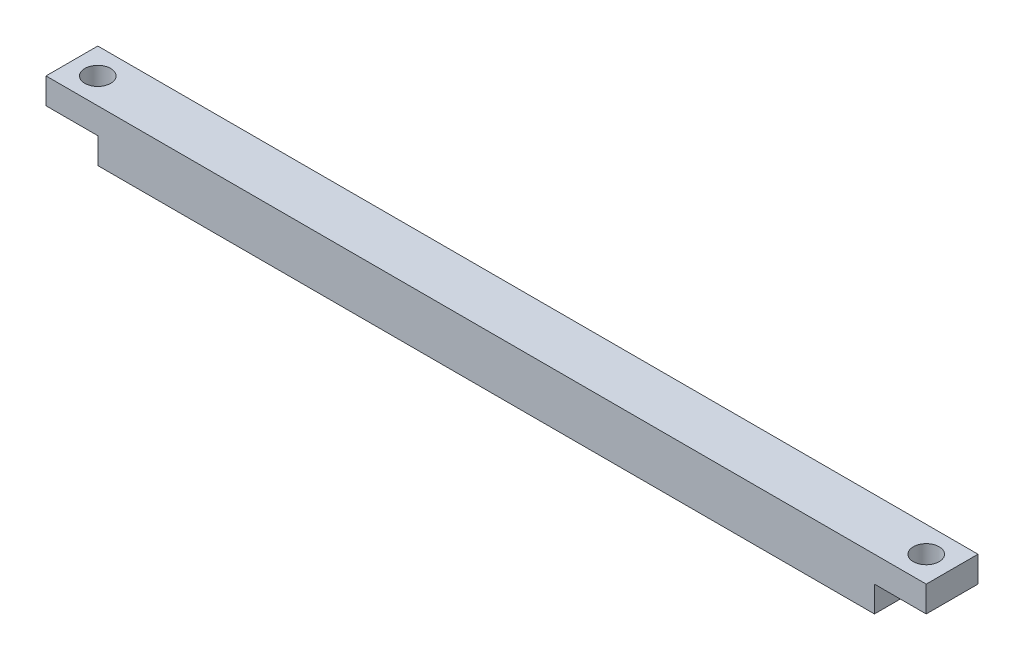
ISO-10303-21;
HEADER;
FILE_DESCRIPTION(('STEP AP214'),'2;1');
FILE_NAME('part.step','',(''),(''),'','','');
FILE_SCHEMA(('AUTOMOTIVE_DESIGN { 1 0 10303 214 1 1 1 1 }'));
ENDSEC;
DATA;
#1=APPLICATION_CONTEXT('core data for automotive mechanical design processes');
#2=APPLICATION_PROTOCOL_DEFINITION('international standard','automotive_design',2000,#1);
#3=PRODUCT_CONTEXT('',#1,'mechanical');
#4=PRODUCT('Part','Part','',(#3));
#5=PRODUCT_RELATED_PRODUCT_CATEGORY('part','',(#4));
#6=PRODUCT_DEFINITION_FORMATION('','',#4);
#7=PRODUCT_DEFINITION_CONTEXT('part definition',#1,'design');
#8=PRODUCT_DEFINITION('design','',#6,#7);
#9=PRODUCT_DEFINITION_SHAPE('','',#8);
#10=(LENGTH_UNIT() NAMED_UNIT(*) SI_UNIT(.MILLI.,.METRE.));
#11=(NAMED_UNIT(*) PLANE_ANGLE_UNIT() SI_UNIT($,.RADIAN.));
#12=(NAMED_UNIT(*) SI_UNIT($,.STERADIAN.) SOLID_ANGLE_UNIT());
#13=UNCERTAINTY_MEASURE_WITH_UNIT(LENGTH_MEASURE(1.E-05),#10,'distance_accuracy_value','');
#14=(GEOMETRIC_REPRESENTATION_CONTEXT(3) GLOBAL_UNCERTAINTY_ASSIGNED_CONTEXT((#13)) GLOBAL_UNIT_ASSIGNED_CONTEXT((#10,
#11,#12)) REPRESENTATION_CONTEXT('',''));
#15=CARTESIAN_POINT('',(0.,0.,0.));
#16=DIRECTION('',(0.,0.,1.));
#17=DIRECTION('',(1.,0.,0.));
#18=AXIS2_PLACEMENT_3D('',#15,#16,#17);
#19=CARTESIAN_POINT('',(-160.,10.,10.));
#20=DIRECTION('',(0.,-1.,0.));
#21=DIRECTION('',(1.,0.,0.));
#22=AXIS2_PLACEMENT_3D('',#19,#20,#21);
#23=PLANE('',#22);
#24=CARTESIAN_POINT('',(5.,10.,5.));
#25=DIRECTION('',(0.,-1.,0.));
#26=DIRECTION('',(1.,0.,0.));
#27=AXIS2_PLACEMENT_3D('',#24,#25,#26);
#28=CIRCLE('',#27,2.5);
#29=CARTESIAN_POINT('',(7.5,10.,5.));
#30=VERTEX_POINT('',#29);
#31=EDGE_CURVE('E180',#30,#30,#28,.T.);
#32=ORIENTED_EDGE('',*,*,#31,.T.);
#33=EDGE_LOOP('',(#32));
#34=FACE_BOUND('',#33,.T.);
#35=CARTESIAN_POINT('',(-155.,10.0000000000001,5.));
#36=DIRECTION('',(0.,-1.,0.));
#37=DIRECTION('',(1.,0.,0.));
#38=AXIS2_PLACEMENT_3D('',#35,#36,#37);
#39=CIRCLE('',#38,2.5);
#40=CARTESIAN_POINT('',(-152.5,10.0000000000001,5.));
#41=VERTEX_POINT('',#40);
#42=EDGE_CURVE('E133',#41,#41,#39,.T.);
#43=ORIENTED_EDGE('',*,*,#42,.T.);
#44=EDGE_LOOP('',(#43));
#45=FACE_BOUND('',#44,.T.);
#46=DIRECTION('',(-1.,0.,0.));
#47=VECTOR('',#46,1.);
#48=CARTESIAN_POINT('',(-160.,10.,0.));
#49=LINE('',#48,#47);
#50=CARTESIAN_POINT('',(10.,10.,0.));
#51=VERTEX_POINT('',#50);
#52=CARTESIAN_POINT('',(-160.,10.,0.));
#53=VERTEX_POINT('',#52);
#54=EDGE_CURVE('E129',#51,#53,#49,.T.);
#55=ORIENTED_EDGE('',*,*,#54,.T.);
#56=DIRECTION('',(0.,0.,-1.));
#57=VECTOR('',#56,1.);
#58=CARTESIAN_POINT('',(-160.,10.,10.));
#59=LINE('',#58,#57);
#60=CARTESIAN_POINT('',(-160.,10.,10.));
#61=VERTEX_POINT('',#60);
#62=EDGE_CURVE('E11',#61,#53,#59,.T.);
#63=ORIENTED_EDGE('',*,*,#62,.F.);
#64=DIRECTION('',(-1.,0.,0.));
#65=VECTOR('',#64,1.);
#66=CARTESIAN_POINT('',(-160.,10.,10.));
#67=LINE('',#66,#65);
#68=CARTESIAN_POINT('',(10.,10.,10.));
#69=VERTEX_POINT('',#68);
#70=EDGE_CURVE('E144',#69,#61,#67,.T.);
#71=ORIENTED_EDGE('',*,*,#70,.F.);
#72=DIRECTION('',(0.,0.,-1.));
#73=VECTOR('',#72,1.);
#74=CARTESIAN_POINT('',(10.,10.,10.));
#75=LINE('',#74,#73);
#76=EDGE_CURVE('E125',#69,#51,#75,.T.);
#77=ORIENTED_EDGE('',*,*,#76,.T.);
#78=EDGE_LOOP('',(#55,#63,#71,#77));
#79=FACE_BOUND('',#78,.T.);
#80=ADVANCED_FACE('F33',(#34,#45,#79),#23,.F.);
#81=CARTESIAN_POINT('',(-160.,10.,10.));
#82=DIRECTION('',(1.,0.,0.));
#83=DIRECTION('',(0.,0.,-1.));
#84=AXIS2_PLACEMENT_3D('',#81,#82,#83);
#85=PLANE('',#84);
#86=DIRECTION('',(0.,-1.,0.));
#87=VECTOR('',#86,1.);
#88=CARTESIAN_POINT('',(-160.,10.,0.));
#89=LINE('',#88,#87);
#90=CARTESIAN_POINT('',(-160.,5.00000000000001,0.));
#91=VERTEX_POINT('',#90);
#92=EDGE_CURVE('E132',#53,#91,#89,.T.);
#93=ORIENTED_EDGE('',*,*,#92,.T.);
#94=DIRECTION('',(0.,0.,-1.));
#95=VECTOR('',#94,1.);
#96=CARTESIAN_POINT('',(-160.,5.00000000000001,10.));
#97=LINE('',#96,#95);
#98=CARTESIAN_POINT('',(-160.,5.00000000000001,10.));
#99=VERTEX_POINT('',#98);
#100=EDGE_CURVE('E41',#99,#91,#97,.T.);
#101=ORIENTED_EDGE('',*,*,#100,.F.);
#102=DIRECTION('',(0.,-1.,0.));
#103=VECTOR('',#102,1.);
#104=CARTESIAN_POINT('',(-160.,10.,10.));
#105=LINE('',#104,#103);
#106=EDGE_CURVE('E92',#61,#99,#105,.T.);
#107=ORIENTED_EDGE('',*,*,#106,.F.);
#108=ORIENTED_EDGE('',*,*,#62,.T.);
#109=EDGE_LOOP('',(#93,#101,#107,#108));
#110=FACE_BOUND('',#109,.T.);
#111=ADVANCED_FACE('F208',(#110),#85,.F.);
#112=CARTESIAN_POINT('',(-160.,5.00000000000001,10.));
#113=DIRECTION('',(0.,1.,0.));
#114=DIRECTION('',(-1.,0.,0.));
#115=AXIS2_PLACEMENT_3D('',#112,#113,#114);
#116=PLANE('',#115);
#117=CARTESIAN_POINT('',(-155.,5.00000000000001,5.));
#118=DIRECTION('',(0.,-1.,0.));
#119=DIRECTION('',(1.,0.,0.));
#120=AXIS2_PLACEMENT_3D('',#117,#118,#119);
#121=CIRCLE('',#120,2.5);
#122=CARTESIAN_POINT('',(-152.5,5.00000000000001,5.));
#123=VERTEX_POINT('',#122);
#124=EDGE_CURVE('E177',#123,#123,#121,.T.);
#125=ORIENTED_EDGE('',*,*,#124,.F.);
#126=EDGE_LOOP('',(#125));
#127=FACE_BOUND('',#126,.T.);
#128=DIRECTION('',(1.,0.,0.));
#129=VECTOR('',#128,1.);
#130=CARTESIAN_POINT('',(-160.,5.00000000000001,0.));
#131=LINE('',#130,#129);
#132=CARTESIAN_POINT('',(-150.,5.,0.));
#133=VERTEX_POINT('',#132);
#134=EDGE_CURVE('E135',#91,#133,#131,.T.);
#135=ORIENTED_EDGE('',*,*,#134,.T.);
#136=DIRECTION('',(0.,0.,-1.));
#137=VECTOR('',#136,1.);
#138=CARTESIAN_POINT('',(-150.,5.,10.));
#139=LINE('',#138,#137);
#140=CARTESIAN_POINT('',(-150.,5.,10.));
#141=VERTEX_POINT('',#140);
#142=EDGE_CURVE('E151',#141,#133,#139,.T.);
#143=ORIENTED_EDGE('',*,*,#142,.F.);
#144=DIRECTION('',(1.,0.,0.));
#145=VECTOR('',#144,1.);
#146=CARTESIAN_POINT('',(-160.,5.00000000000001,10.));
#147=LINE('',#146,#145);
#148=EDGE_CURVE('E159',#99,#141,#147,.T.);
#149=ORIENTED_EDGE('',*,*,#148,.F.);
#150=ORIENTED_EDGE('',*,*,#100,.T.);
#151=EDGE_LOOP('',(#135,#143,#149,#150));
#152=FACE_BOUND('',#151,.T.);
#153=ADVANCED_FACE('F157',(#127,#152),#116,.F.);
#154=CARTESIAN_POINT('',(-150.,5.,10.));
#155=DIRECTION('',(1.,0.,0.));
#156=DIRECTION('',(0.,0.,-1.));
#157=AXIS2_PLACEMENT_3D('',#154,#155,#156);
#158=PLANE('',#157);
#159=DIRECTION('',(0.,-1.,0.));
#160=VECTOR('',#159,1.);
#161=CARTESIAN_POINT('',(-150.,5.,0.));
#162=LINE('',#161,#160);
#163=CARTESIAN_POINT('',(-150.,0.,0.));
#164=VERTEX_POINT('',#163);
#165=EDGE_CURVE('E137',#133,#164,#162,.T.);
#166=ORIENTED_EDGE('',*,*,#165,.T.);
#167=DIRECTION('',(0.,0.,-1.));
#168=VECTOR('',#167,1.);
#169=CARTESIAN_POINT('',(-150.,0.,10.));
#170=LINE('',#169,#168);
#171=CARTESIAN_POINT('',(-150.,0.,10.));
#172=VERTEX_POINT('',#171);
#173=EDGE_CURVE('E148',#172,#164,#170,.T.);
#174=ORIENTED_EDGE('',*,*,#173,.F.);
#175=DIRECTION('',(0.,-1.,0.));
#176=VECTOR('',#175,1.);
#177=CARTESIAN_POINT('',(-150.,5.,10.));
#178=LINE('',#177,#176);
#179=EDGE_CURVE('E171',#141,#172,#178,.T.);
#180=ORIENTED_EDGE('',*,*,#179,.F.);
#181=ORIENTED_EDGE('',*,*,#142,.T.);
#182=EDGE_LOOP('',(#166,#174,#180,#181));
#183=FACE_BOUND('',#182,.T.);
#184=ADVANCED_FACE('F167',(#183),#158,.F.);
#185=CARTESIAN_POINT('',(-150.,0.,10.));
#186=DIRECTION('',(0.,1.,0.));
#187=DIRECTION('',(0.,0.,1.));
#188=AXIS2_PLACEMENT_3D('',#185,#186,#187);
#189=PLANE('',#188);
#190=DIRECTION('',(1.,0.,0.));
#191=VECTOR('',#190,1.);
#192=CARTESIAN_POINT('',(-150.,0.,0.));
#193=LINE('',#192,#191);
#194=CARTESIAN_POINT('',(0.,0.,0.));
#195=VERTEX_POINT('',#194);
#196=EDGE_CURVE('E139',#164,#195,#193,.T.);
#197=ORIENTED_EDGE('',*,*,#196,.T.);
#198=DIRECTION('',(0.,0.,-1.));
#199=VECTOR('',#198,1.);
#200=CARTESIAN_POINT('',(0.,0.,10.));
#201=LINE('',#200,#199);
#202=CARTESIAN_POINT('',(0.,0.,10.));
#203=VERTEX_POINT('',#202);
#204=EDGE_CURVE('E120',#203,#195,#201,.T.);
#205=ORIENTED_EDGE('',*,*,#204,.F.);
#206=DIRECTION('',(1.,0.,0.));
#207=VECTOR('',#206,1.);
#208=CARTESIAN_POINT('',(-150.,0.,10.));
#209=LINE('',#208,#207);
#210=EDGE_CURVE('E111',#172,#203,#209,.T.);
#211=ORIENTED_EDGE('',*,*,#210,.F.);
#212=ORIENTED_EDGE('',*,*,#173,.T.);
#213=EDGE_LOOP('',(#197,#205,#211,#212));
#214=FACE_BOUND('',#213,.T.);
#215=ADVANCED_FACE('F170',(#214),#189,.F.);
#216=CARTESIAN_POINT('',(0.,0.,10.));
#217=DIRECTION('',(-1.,0.,0.));
#218=DIRECTION('',(0.,0.,1.));
#219=AXIS2_PLACEMENT_3D('',#216,#217,#218);
#220=PLANE('',#219);
#221=DIRECTION('',(0.,1.,0.));
#222=VECTOR('',#221,1.);
#223=CARTESIAN_POINT('',(0.,0.,0.));
#224=LINE('',#223,#222);
#225=CARTESIAN_POINT('',(0.,5.,0.));
#226=VERTEX_POINT('',#225);
#227=EDGE_CURVE('E119',#195,#226,#224,.T.);
#228=ORIENTED_EDGE('',*,*,#227,.T.);
#229=DIRECTION('',(0.,0.,-1.));
#230=VECTOR('',#229,1.);
#231=CARTESIAN_POINT('',(0.,5.,10.));
#232=LINE('',#231,#230);
#233=CARTESIAN_POINT('',(0.,5.,10.));
#234=VERTEX_POINT('',#233);
#235=EDGE_CURVE('E116',#234,#226,#232,.T.);
#236=ORIENTED_EDGE('',*,*,#235,.F.);
#237=DIRECTION('',(0.,1.,0.));
#238=VECTOR('',#237,1.);
#239=CARTESIAN_POINT('',(0.,0.,10.));
#240=LINE('',#239,#238);
#241=EDGE_CURVE('E105',#203,#234,#240,.T.);
#242=ORIENTED_EDGE('',*,*,#241,.F.);
#243=ORIENTED_EDGE('',*,*,#204,.T.);
#244=EDGE_LOOP('',(#228,#236,#242,#243));
#245=FACE_BOUND('',#244,.T.);
#246=ADVANCED_FACE('F117',(#245),#220,.F.);
#247=CARTESIAN_POINT('',(0.,5.,10.));
#248=DIRECTION('',(0.,1.,0.));
#249=DIRECTION('',(0.,0.,1.));
#250=AXIS2_PLACEMENT_3D('',#247,#248,#249);
#251=PLANE('',#250);
#252=CARTESIAN_POINT('',(5.,4.9999999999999,5.));
#253=DIRECTION('',(0.,-1.,0.));
#254=DIRECTION('',(1.,0.,0.));
#255=AXIS2_PLACEMENT_3D('',#252,#253,#254);
#256=CIRCLE('',#255,2.5);
#257=CARTESIAN_POINT('',(7.5,4.9999999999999,5.));
#258=VERTEX_POINT('',#257);
#259=EDGE_CURVE('E183',#258,#258,#256,.T.);
#260=ORIENTED_EDGE('',*,*,#259,.F.);
#261=EDGE_LOOP('',(#260));
#262=FACE_BOUND('',#261,.T.);
#263=DIRECTION('',(1.,0.,0.));
#264=VECTOR('',#263,1.);
#265=CARTESIAN_POINT('',(0.,5.,0.));
#266=LINE('',#265,#264);
#267=CARTESIAN_POINT('',(10.,5.,0.));
#268=VERTEX_POINT('',#267);
#269=EDGE_CURVE('E78',#226,#268,#266,.T.);
#270=ORIENTED_EDGE('',*,*,#269,.T.);
#271=DIRECTION('',(0.,0.,-1.));
#272=VECTOR('',#271,1.);
#273=CARTESIAN_POINT('',(10.,5.,10.));
#274=LINE('',#273,#272);
#275=CARTESIAN_POINT('',(10.,5.,10.));
#276=VERTEX_POINT('',#275);
#277=EDGE_CURVE('E121',#276,#268,#274,.T.);
#278=ORIENTED_EDGE('',*,*,#277,.F.);
#279=DIRECTION('',(1.,0.,0.));
#280=VECTOR('',#279,1.);
#281=CARTESIAN_POINT('',(0.,5.,10.));
#282=LINE('',#281,#280);
#283=EDGE_CURVE('E109',#234,#276,#282,.T.);
#284=ORIENTED_EDGE('',*,*,#283,.F.);
#285=ORIENTED_EDGE('',*,*,#235,.T.);
#286=EDGE_LOOP('',(#270,#278,#284,#285));
#287=FACE_BOUND('',#286,.T.);
#288=ADVANCED_FACE('F123',(#262,#287),#251,.F.);
#289=CARTESIAN_POINT('',(10.,10.,10.));
#290=DIRECTION('',(-1.,0.,0.));
#291=DIRECTION('',(0.,0.,1.));
#292=AXIS2_PLACEMENT_3D('',#289,#290,#291);
#293=PLANE('',#292);
#294=DIRECTION('',(0.,1.,0.));
#295=VECTOR('',#294,1.);
#296=CARTESIAN_POINT('',(10.,10.,0.));
#297=LINE('',#296,#295);
#298=EDGE_CURVE('E84',#268,#51,#297,.T.);
#299=ORIENTED_EDGE('',*,*,#298,.T.);
#300=ORIENTED_EDGE('',*,*,#76,.F.);
#301=DIRECTION('',(0.,1.,0.));
#302=VECTOR('',#301,1.);
#303=CARTESIAN_POINT('',(10.,10.,10.));
#304=LINE('',#303,#302);
#305=EDGE_CURVE('E49',#276,#69,#304,.T.);
#306=ORIENTED_EDGE('',*,*,#305,.F.);
#307=ORIENTED_EDGE('',*,*,#277,.T.);
#308=EDGE_LOOP('',(#299,#300,#306,#307));
#309=FACE_BOUND('',#308,.T.);
#310=ADVANCED_FACE('F199',(#309),#293,.F.);
#311=CARTESIAN_POINT('',(0.,0.,10.));
#312=DIRECTION('',(0.,0.,-1.));
#313=DIRECTION('',(-1.,0.,0.));
#314=AXIS2_PLACEMENT_3D('',#311,#312,#313);
#315=PLANE('',#314);
#316=ORIENTED_EDGE('',*,*,#70,.T.);
#317=ORIENTED_EDGE('',*,*,#106,.T.);
#318=ORIENTED_EDGE('',*,*,#148,.T.);
#319=ORIENTED_EDGE('',*,*,#179,.T.);
#320=ORIENTED_EDGE('',*,*,#210,.T.);
#321=ORIENTED_EDGE('',*,*,#241,.T.);
#322=ORIENTED_EDGE('',*,*,#283,.T.);
#323=ORIENTED_EDGE('',*,*,#305,.T.);
#324=EDGE_LOOP('',(#316,#317,#318,#319,#320,#321,#322,#323));
#325=FACE_BOUND('',#324,.T.);
#326=ADVANCED_FACE('F107',(#325),#315,.F.);
#327=CARTESIAN_POINT('',(0.,0.,0.));
#328=DIRECTION('',(0.,0.,-1.));
#329=DIRECTION('',(-1.,0.,0.));
#330=AXIS2_PLACEMENT_3D('',#327,#328,#329);
#331=PLANE('',#330);
#332=ORIENTED_EDGE('',*,*,#54,.F.);
#333=ORIENTED_EDGE('',*,*,#298,.F.);
#334=ORIENTED_EDGE('',*,*,#269,.F.);
#335=ORIENTED_EDGE('',*,*,#227,.F.);
#336=ORIENTED_EDGE('',*,*,#196,.F.);
#337=ORIENTED_EDGE('',*,*,#165,.F.);
#338=ORIENTED_EDGE('',*,*,#134,.F.);
#339=ORIENTED_EDGE('',*,*,#92,.F.);
#340=EDGE_LOOP('',(#332,#333,#334,#335,#336,#337,#338,#339));
#341=FACE_BOUND('',#340,.T.);
#342=ADVANCED_FACE('F163',(#341),#331,.T.);
#343=CARTESIAN_POINT('',(-155.,10.0000000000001,5.));
#344=DIRECTION('',(0.,-1.,0.));
#345=DIRECTION('',(1.,0.,0.));
#346=AXIS2_PLACEMENT_3D('',#343,#344,#345);
#347=CYLINDRICAL_SURFACE('',#346,2.5);
#348=ORIENTED_EDGE('',*,*,#42,.F.);
#349=EDGE_LOOP('',(#348));
#350=FACE_BOUND('',#349,.T.);
#351=ORIENTED_EDGE('',*,*,#124,.T.);
#352=EDGE_LOOP('',(#351));
#353=FACE_BOUND('',#352,.T.);
#354=ADVANCED_FACE('F194',(#350,#353),#347,.F.);
#355=CARTESIAN_POINT('',(5.,10.,5.));
#356=DIRECTION('',(0.,-1.,0.));
#357=DIRECTION('',(1.,0.,0.));
#358=AXIS2_PLACEMENT_3D('',#355,#356,#357);
#359=CYLINDRICAL_SURFACE('',#358,2.5);
#360=ORIENTED_EDGE('',*,*,#31,.F.);
#361=EDGE_LOOP('',(#360));
#362=FACE_BOUND('',#361,.T.);
#363=ORIENTED_EDGE('',*,*,#259,.T.);
#364=EDGE_LOOP('',(#363));
#365=FACE_BOUND('',#364,.T.);
#366=ADVANCED_FACE('F191',(#362,#365),#359,.F.);
#367=CLOSED_SHELL('',(#80,#111,#153,#184,#215,#246,#288,#310,#326,#342,#354,#366));
#368=MANIFOLD_SOLID_BREP('B2',#367);
#369=ADVANCED_BREP_SHAPE_REPRESENTATION('',(#18,#368),#14);
#370=SHAPE_DEFINITION_REPRESENTATION(#9,#369);
ENDSEC;
END-ISO-10303-21;
